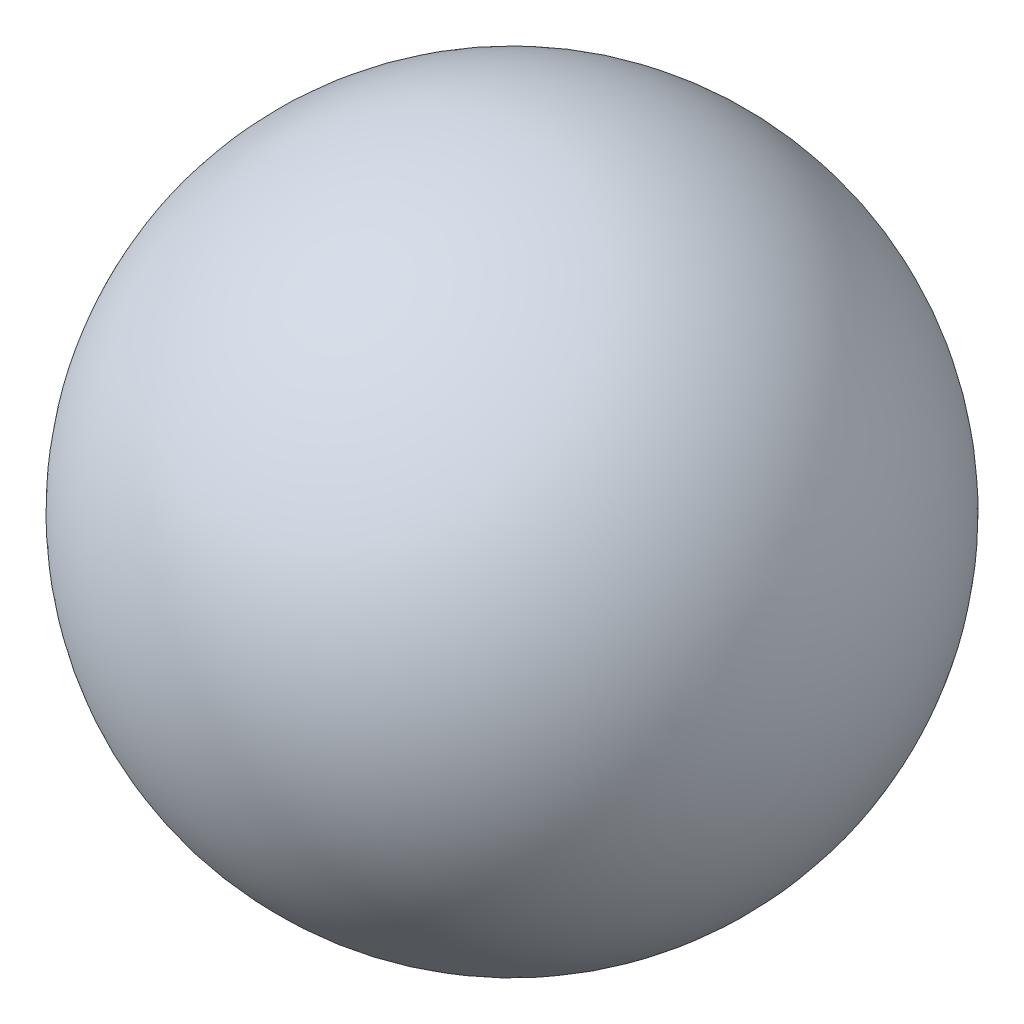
ISO-10303-21;
HEADER;
FILE_DESCRIPTION(('STEP AP214'),'2;1');
FILE_NAME('part.step','',(''),(''),'','','');
FILE_SCHEMA(('AUTOMOTIVE_DESIGN { 1 0 10303 214 1 1 1 1 }'));
ENDSEC;
DATA;
#1=APPLICATION_CONTEXT('core data for automotive mechanical design processes');
#2=APPLICATION_PROTOCOL_DEFINITION('international standard','automotive_design',2000,#1);
#3=PRODUCT_CONTEXT('',#1,'mechanical');
#4=PRODUCT('Part','Part','',(#3));
#5=PRODUCT_RELATED_PRODUCT_CATEGORY('part','',(#4));
#6=PRODUCT_DEFINITION_FORMATION('','',#4);
#7=PRODUCT_DEFINITION_CONTEXT('part definition',#1,'design');
#8=PRODUCT_DEFINITION('design','',#6,#7);
#9=PRODUCT_DEFINITION_SHAPE('','',#8);
#10=(LENGTH_UNIT() NAMED_UNIT(*) SI_UNIT(.MILLI.,.METRE.));
#11=(NAMED_UNIT(*) PLANE_ANGLE_UNIT() SI_UNIT($,.RADIAN.));
#12=(NAMED_UNIT(*) SI_UNIT($,.STERADIAN.) SOLID_ANGLE_UNIT());
#13=UNCERTAINTY_MEASURE_WITH_UNIT(LENGTH_MEASURE(1.E-05),#10,'distance_accuracy_value','');
#14=(GEOMETRIC_REPRESENTATION_CONTEXT(3) GLOBAL_UNCERTAINTY_ASSIGNED_CONTEXT((#13)) GLOBAL_UNIT_ASSIGNED_CONTEXT((#10,
#11,#12)) REPRESENTATION_CONTEXT('',''));
#15=CARTESIAN_POINT('',(0.,0.,0.));
#16=DIRECTION('',(0.,0.,1.));
#17=DIRECTION('',(1.,0.,0.));
#18=AXIS2_PLACEMENT_3D('',#15,#16,#17);
#19=CARTESIAN_POINT('',(2.7,0.,-2.95));
#20=DIRECTION('',(-1.,0.,0.));
#21=DIRECTION('',(0.,0.,-1.));
#22=AXIS2_PLACEMENT_3D('',#19,#20,#21);
#23=SPHERICAL_SURFACE('',#22,1.95);
#24=CARTESIAN_POINT('',(0.75,0.,-2.95));
#25=VERTEX_POINT('',#24);
#26=VERTEX_LOOP('',#25);
#27=FACE_BOUND('',#26,.T.);
#28=ADVANCED_FACE('F27',(#27),#23,.T.);
#29=CLOSED_SHELL('',(#28));
#30=MANIFOLD_SOLID_BREP('B2',#29);
#31=ADVANCED_BREP_SHAPE_REPRESENTATION('',(#18,#30),#14);
#32=SHAPE_DEFINITION_REPRESENTATION(#9,#31);
ENDSEC;
END-ISO-10303-21;
